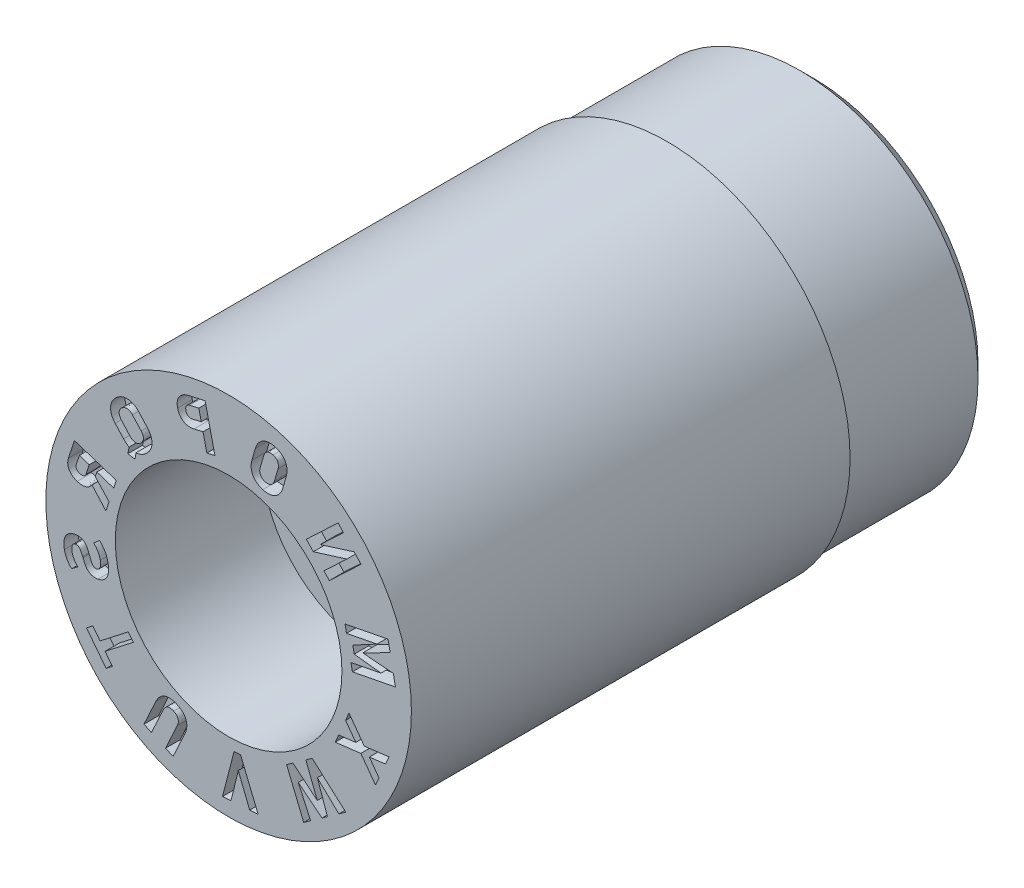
from build123d import *

# Parameters (mm, degrees)
SKETCH4_W          = 2
SKETCH4_H          = 1
CUT_EXTRUDE1_DEPTH = 0.2


with BuildPart() as part:
    # Sketch1 → Revolve1 (revolve)
    with BuildSketch(Plane(origin=(0, 0, 0), x_dir=(0, 0, -1), z_dir=(1, 0, 0)), mode=Mode.PRIVATE) as revolve1_sk:
        Polygon((0, 2.5), (0, 1.55), (2, 1.55), (2, 0.8), (8, 0.8), (8, 2.25), (7.75, 2.5), align=None)
    revolve(revolve1_sk.sketch.rotate(Axis((0, 0, 3.797909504), (0, 0, -1)), 90), axis=Axis((0, 0, 3.797909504), (0, 0, -1)))

    # Sketch4 → Cut-Revolve1 (revolve, cut)
    with BuildSketch(Plane(origin=(0, 0, 0), x_dir=(0, 0, -1), z_dir=(1, 0, 0)), mode=Mode.PRIVATE) as cut_revolve1_sk:
        with Locations((7, 2.935)):
            Rectangle(SKETCH4_W, SKETCH4_H)
    revolve(cut_revolve1_sk.sketch.rotate(Axis((0, 0, 0), (0, 0, -1)), 90), axis=Axis((0, 0, 0), (0, 0, -1)), mode=Mode.SUBTRACT)

    # Sketch6 → Cut-Extrude1 (cut)
    # profile 1 of 12: a face of its own
    with BuildSketch(Plane.XY):
        Polygon((2.20943311, 0.550372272), (2.180812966, 0.696563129), (1.592055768, 0.581519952), (1.611801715, 0.480679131), (2.029671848, 0.562317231), (1.698598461, 0.384971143), (1.717809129, 0.287079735), (2.083836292, 0.24583009), (1.673342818, 0.165633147), (1.693088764, 0.064792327), (2.281845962, 0.179835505), (2.253225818, 0.326026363), (1.834465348, 0.360595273), align=None)
    # profile 2 of 12: a face of its own
    with BuildSketch(Plane.XY):
        Polygon((1.811695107, 1.399001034), (1.717052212, 1.499012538), (1.25324376, 1.352655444), (1.571096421, 1.653347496), (1.497187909, 1.731422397), (1.063468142, 1.321117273), (1.15857305, 1.22059101), (1.616688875, 1.362763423), (1.303951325, 1.0668995), (1.377975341, 0.98869591), align=None)
    # profile 3 of 12: a face of its own
    with BuildSketch(Plane.XY):
        with BuildLine():
            Line((0.740518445, 1.762644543), (0.788028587, 1.926385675))
            add(Edge.make_bspline(
                [(0.788028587, 1.926385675), (0.79101625, 1.936685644), (0.794493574, 1.952186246), (0.79784375, 1.972851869), (0.798813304, 1.987962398), (0.799425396, 2.00278116), (0.798506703, 2.017368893), (0.796958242, 2.031715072), (0.794395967, 2.045793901), (0.791042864, 2.059559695), (0.786487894, 2.072797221), (0.781263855, 2.085609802), (0.775123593, 2.097914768), (0.768115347, 2.109756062), (0.760281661, 2.121107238), (0.751497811, 2.131923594), (0.741861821, 2.142159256), (0.73151523, 2.151973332), (0.720368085, 2.161032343), (0.708517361, 2.16942173), (0.695965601, 2.177091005), (0.682703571, 2.183989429), (0.663945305, 2.192637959), (0.649039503, 2.197557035), (0.638911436, 2.200623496)],
                knots=[0, 0, 0, 0, 0.091423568, 0.135488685, 0.178425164, 0.22052978, 0.261924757, 0.302982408, 0.343591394, 0.383929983, 0.42373898, 0.46291104, 0.501914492, 0.540950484, 0.580219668, 0.619478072, 0.659710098, 0.700084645, 0.741061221, 0.782148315, 0.823883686, 0.866451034, 0.909630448, 1, 1, 1, 1], degree=3))
            add(Edge.make_bspline(
                [(0.638911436, 2.200623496), (0.6287683, 2.203686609), (0.61344122, 2.207100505), (0.592964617, 2.210124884), (0.578016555, 2.211428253), (0.563278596, 2.211527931), (0.54878859, 2.210923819), (0.534503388, 2.209242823), (0.520528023, 2.206485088), (0.506830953, 2.203090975), (0.493695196, 2.198469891), (0.480948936, 2.193130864), (0.468658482, 2.187010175), (0.456944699, 2.179742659), (0.445681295, 2.171753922), (0.434771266, 2.162939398), (0.424599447, 2.153086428), (0.414833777, 2.142615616), (0.40584282, 2.131278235), (0.397317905, 2.119375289), (0.389758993, 2.106566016), (0.382680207, 2.0932095), (0.374146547, 2.074115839), (0.368957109, 2.059092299), (0.365990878, 2.048788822)],
                knots=[0, 0, 0, 0, 0.090266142, 0.133661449, 0.176402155, 0.218059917, 0.259222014, 0.299977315, 0.340536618, 0.380604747, 0.420164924, 0.459106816, 0.49837752, 0.53707214, 0.576497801, 0.616054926, 0.656506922, 0.697127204, 0.738031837, 0.779780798, 0.821838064, 0.864718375, 0.908600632, 1, 1, 1, 1], degree=3))
            Line((0.365990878, 2.048788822), (0.318480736, 1.88504769))
            add(Edge.make_bspline(
                [(0.318480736, 1.88504769), (0.315511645, 1.87474647), (0.311980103, 1.859249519), (0.308719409, 1.838596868), (0.307512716, 1.823500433), (0.307131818, 1.80867175), (0.307986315, 1.794063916), (0.30956774, 1.779721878), (0.312058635, 1.76565349), (0.315630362, 1.751983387), (0.319854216, 1.738675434), (0.325157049, 1.725892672), (0.331288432, 1.713590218), (0.33824392, 1.701728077), (0.346285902, 1.690482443), (0.354943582, 1.679521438), (0.364663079, 1.669289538), (0.374960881, 1.659427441), (0.386239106, 1.65053656), (0.398049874, 1.642105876), (0.41061042, 1.634446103), (0.423910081, 1.627536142), (0.442683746, 1.618821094), (0.457662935, 1.613981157), (0.467766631, 1.61084765)],
                knots=[0, 0, 0, 0, 0.09139278, 0.135443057, 0.17820288, 0.220472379, 0.261853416, 0.302897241, 0.34349255, 0.383578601, 0.423325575, 0.462484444, 0.50147476, 0.540497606, 0.579619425, 0.619305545, 0.659524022, 0.699884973, 0.740807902, 0.78188116, 0.823602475, 0.866155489, 0.909664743, 1, 1, 1, 1], degree=3))
            add(Edge.make_bspline(
                [(0.467766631, 1.61084765), (0.477929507, 1.607867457), (0.493234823, 1.604366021), (0.51367666, 1.601333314), (0.528595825, 1.600126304), (0.543295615, 1.600004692), (0.557787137, 1.600611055), (0.572068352, 1.602304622), (0.586030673, 1.605005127), (0.599673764, 1.60858804), (0.612863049, 1.613028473), (0.62562495, 1.618366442), (0.637815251, 1.62466937), (0.649587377, 1.631748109), (0.660926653, 1.63966272), (0.671584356, 1.648709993), (0.681978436, 1.65831583), (0.691662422, 1.668832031), (0.70067011, 1.680151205), (0.709190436, 1.692059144), (0.716750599, 1.704867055), (0.723829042, 1.718223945), (0.732362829, 1.737317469), (0.737552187, 1.752341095), (0.740518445, 1.762644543)],
                knots=[0, 0, 0, 0, 0.090323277, 0.133749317, 0.176212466, 0.21789973, 0.259090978, 0.299875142, 0.340463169, 0.380322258, 0.420128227, 0.459097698, 0.498218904, 0.537095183, 0.576227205, 0.616034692, 0.656263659, 0.696912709, 0.737846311, 0.779624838, 0.821711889, 0.864622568, 0.908535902, 1, 1, 1, 1], degree=3))
        make_face()
        with BuildLine():
            Line((0.430689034, 1.849656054), (0.479700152, 2.01896075))
            add(Edge.make_bspline(
                [(0.479700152, 2.01896075), (0.48253023, 2.028493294), (0.488025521, 2.042115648), (0.498207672, 2.058359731), (0.507024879, 2.068786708), (0.516874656, 2.077739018), (0.52766449, 2.085133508), (0.539418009, 2.090723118), (0.552046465, 2.094446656), (0.565260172, 2.096634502), (0.583998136, 2.097163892), (0.598095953, 2.094465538), (0.607378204, 2.091759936)],
                knots=[0, 0, 0, 0, 0.180182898, 0.264366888, 0.346348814, 0.426789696, 0.504846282, 0.582496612, 0.661552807, 0.742625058, 0.824550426, 1, 1, 1, 1], degree=3))
            add(Edge.make_bspline(
                [(0.607378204, 2.091759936), (0.616727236, 2.089255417), (0.629859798, 2.083647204), (0.645555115, 2.073481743), (0.655508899, 2.064510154), (0.66397786, 2.054472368), (0.671021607, 2.043536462), (0.676003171, 2.031433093), (0.679624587, 2.018614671), (0.681501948, 2.005074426), (0.681437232, 1.985921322), (0.678717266, 1.971509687), (0.675951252, 1.961983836)],
                knots=[0, 0, 0, 0, 0.175126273, 0.257195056, 0.338134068, 0.417160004, 0.494867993, 0.572993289, 0.65360079, 0.735948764, 0.820030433, 1, 1, 1, 1], degree=3))
            Line((0.675951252, 1.961983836), (0.626940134, 1.79267914))
            add(Edge.make_bspline(
                [(0.626940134, 1.79267914), (0.624108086, 1.783147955), (0.618618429, 1.769521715), (0.608406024, 1.753249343), (0.599579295, 1.742780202), (0.589740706, 1.733803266), (0.578896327, 1.726496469), (0.567215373, 1.720849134), (0.554643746, 1.716973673), (0.541415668, 1.714947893), (0.522718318, 1.714532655), (0.508604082, 1.71703967), (0.499365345, 1.719814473)],
                knots=[0, 0, 0, 0, 0.180243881, 0.264456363, 0.347198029, 0.427666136, 0.505071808, 0.583374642, 0.661976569, 0.74258696, 0.825153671, 1, 1, 1, 1], degree=3))
            add(Edge.make_bspline(
                [(0.499365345, 1.719814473), (0.489998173, 1.722372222), (0.476797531, 1.727950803), (0.461146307, 1.738158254), (0.451120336, 1.746972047), (0.44264669, 1.757034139), (0.435703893, 1.768058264), (0.430522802, 1.780107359), (0.426967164, 1.792927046), (0.42504371, 1.80649512), (0.425265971, 1.825685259), (0.427885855, 1.840129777), (0.430689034, 1.849656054)],
                knots=[0, 0, 0, 0, 0.175658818, 0.257640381, 0.33764587, 0.416587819, 0.495197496, 0.5728229, 0.653344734, 0.735605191, 0.820221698, 1, 1, 1, 1], degree=3))
        make_face(mode=Mode.SUBTRACT)
    # profile 4 of 12: a face of its own
    with BuildSketch(Plane.XY):
        with BuildLine():
            Line((-0.349619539, 1.887561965), (-0.297495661, 1.661224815))
            Line((-0.297495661, 1.661224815), (-0.187530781, 1.686483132))
            Line((-0.187530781, 1.686483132), (-0.321891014, 2.269914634))
            Line((-0.321891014, 2.269914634), (-0.55585496, 2.216100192))
            add(Edge.make_bspline(
                [(-0.55585496, 2.216100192), (-0.573133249, 2.212296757), (-0.597823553, 2.203759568), (-0.627560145, 2.187001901), (-0.646910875, 2.17221902), (-0.663908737, 2.155476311), (-0.677898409, 2.136663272), (-0.689206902, 2.116220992), (-0.697261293, 2.09405388), (-0.702598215, 2.070633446), (-0.705028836, 2.037221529), (-0.702038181, 2.011783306), (-0.698008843, 1.994967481)],
                knots=[0, 0, 0, 0, 0.179264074, 0.262914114, 0.345094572, 0.425466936, 0.504017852, 0.581987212, 0.661488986, 0.742357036, 0.824785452, 1, 1, 1, 1], degree=3))
            add(Edge.make_bspline(
                [(-0.698008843, 1.994967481), (-0.694085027, 1.978136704), (-0.68591246, 1.953841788), (-0.668936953, 1.924968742), (-0.653950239, 1.906300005), (-0.63694929, 1.890038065), (-0.617909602, 1.876660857), (-0.597078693, 1.866089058), (-0.574632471, 1.858326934), (-0.550780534, 1.853765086), (-0.51677128, 1.851637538), (-0.490839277, 1.854977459), (-0.473639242, 1.859013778)],
                knots=[0, 0, 0, 0, 0.175740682, 0.257985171, 0.339043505, 0.41817568, 0.496190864, 0.574525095, 0.654741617, 0.73663625, 0.820445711, 1, 1, 1, 1], degree=3))
            Line((-0.473639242, 1.859013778), (-0.349619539, 1.887561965))
        make_face()
        with BuildLine():
            Line((-0.374006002, 1.993455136), (-0.500806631, 1.964241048))
            add(Edge.make_bspline(
                [(-0.500806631, 1.964241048), (-0.50703459, 1.962914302), (-0.516478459, 1.961674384), (-0.528897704, 1.96280841), (-0.537645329, 1.965055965), (-0.545995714, 1.96830671), (-0.553648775, 1.97298082), (-0.560816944, 1.978534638), (-0.567189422, 1.985297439), (-0.572864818, 1.992992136), (-0.57924717, 2.004776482), (-0.582665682, 2.014428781), (-0.584041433, 2.021222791)],
                knots=[0, 0, 0, 0, 0.168779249, 0.249596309, 0.32843233, 0.407061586, 0.485720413, 0.564814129, 0.646318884, 0.730711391, 0.817085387, 1, 1, 1, 1], degree=3))
            add(Edge.make_bspline(
                [(-0.584041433, 2.021222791), (-0.585591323, 2.028062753), (-0.587071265, 2.03829928), (-0.586502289, 2.05180504), (-0.584863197, 2.061260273), (-0.58220069, 2.070213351), (-0.578331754, 2.07846219), (-0.573392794, 2.085918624), (-0.5673683, 2.092514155), (-0.560513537, 2.098397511), (-0.549692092, 2.104846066), (-0.540637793, 2.108140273), (-0.534279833, 2.109509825)],
                knots=[0, 0, 0, 0, 0.184525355, 0.269846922, 0.354276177, 0.436138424, 0.514600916, 0.592865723, 0.67024582, 0.748708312, 0.829398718, 1, 1, 1, 1], degree=3))
            Line((-0.534279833, 2.109509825), (-0.407461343, 2.138728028))
            Line((-0.407461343, 2.138728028), (-0.374006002, 1.993455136))
        make_face(mode=Mode.SUBTRACT)
    # profile 5 of 12: a face of its own
    with BuildSketch(Plane.XY):
        with BuildLine():
            Line((-1.802329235, 0.685143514), (-1.572052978, 0.610220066))
            Line((-1.572052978, 0.610220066), (-1.536933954, 0.718097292))
            Line((-1.536933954, 0.718097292), (-2.109772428, 0.904477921))
            Line((-2.109772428, 0.904477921), (-2.191337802, 0.653698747))
            add(Edge.make_bspline(
                [(-2.191337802, 0.653698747), (-2.196431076, 0.638769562), (-2.200715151, 0.615861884), (-2.201039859, 0.585321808), (-2.197602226, 0.563588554), (-2.191453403, 0.542792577), (-2.182250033, 0.523212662), (-2.170186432, 0.505002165), (-2.155381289, 0.488172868), (-2.138024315, 0.472910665), (-2.110760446, 0.454868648), (-2.087756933, 0.444882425), (-2.071591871, 0.439637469)],
                knots=[0, 0, 0, 0, 0.170965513, 0.251492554, 0.330726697, 0.409120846, 0.486425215, 0.564906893, 0.645708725, 0.729313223, 0.815308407, 1, 1, 1, 1], degree=3))
            add(Edge.make_bspline(
                [(-2.071591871, 0.439637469), (-2.05546635, 0.434344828), (-2.03105239, 0.428858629), (-1.99843022, 0.427553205), (-1.975448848, 0.429720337), (-1.953459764, 0.434390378), (-1.9329949, 0.442252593), (-1.913927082, 0.45268094), (-1.89673242, 0.466053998), (-1.881619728, 0.481391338), (-1.873125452, 0.492834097), (-1.869352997, 0.498636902)],
                knots=[0, 0, 0, 0, 0.184562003, 0.270099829, 0.353927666, 0.434921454, 0.513703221, 0.591414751, 0.670359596, 0.749632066, 0.824814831, 0.824814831, 0.824814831, 0.824814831], degree=3))
            Line((-1.869352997, 0.498636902), (-1.677853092, 0.28494394))
            Line((-1.677853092, 0.28494394), (-1.63528215, 0.415688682))
            Line((-1.63528215, 0.415688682), (-1.82365503, 0.619609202))
            Line((-1.82365503, 0.619609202), (-1.802329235, 0.685143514))
        make_face()
        with BuildLine():
            Line((-1.906319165, 0.718978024), (-1.950041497, 0.584652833))
            add(Edge.make_bspline(
                [(-1.950041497, 0.584652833), (-1.951864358, 0.579467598), (-1.955102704, 0.571849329), (-1.96194396, 0.563485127), (-1.9676883, 0.558104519), (-1.974154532, 0.553519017), (-1.981460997, 0.550147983), (-1.989339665, 0.547663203), (-1.997835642, 0.546313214), (-2.006780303, 0.545867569), (-2.019499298, 0.546754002), (-2.029127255, 0.548463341), (-2.035461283, 0.550560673)],
                knots=[0, 0, 0, 0, 0.160903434, 0.236925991, 0.313022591, 0.389571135, 0.466559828, 0.546297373, 0.62936432, 0.716274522, 0.806460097, 1, 1, 1, 1], degree=3))
            add(Edge.make_bspline(
                [(-2.035461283, 0.550560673), (-2.041739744, 0.552721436), (-2.050838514, 0.556412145), (-2.061634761, 0.563224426), (-2.068582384, 0.568889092), (-2.074508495, 0.57507162), (-2.07966628, 0.581567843), (-2.083295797, 0.588784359), (-2.086177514, 0.596225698), (-2.087531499, 0.604044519), (-2.088339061, 0.614927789), (-2.086316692, 0.623111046), (-2.084739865, 0.628443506)],
                knots=[0, 0, 0, 0, 0.192761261, 0.282732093, 0.369094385, 0.451825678, 0.530688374, 0.608347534, 0.685012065, 0.761064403, 0.837446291, 1, 1, 1, 1], degree=3))
            Line((-2.084739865, 0.628443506), (-2.041007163, 0.762800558))
            Line((-2.041007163, 0.762800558), (-1.906319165, 0.718978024))
        make_face(mode=Mode.SUBTRACT)
    # profile 6 of 12: a face of its own
    with BuildSketch(Plane.XY):
        Polygon((-1.758557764, -1.294256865), (-1.858436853, -1.16574307), (-1.944117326, -1.232303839), (-1.675281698, -1.578212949), (-1.589601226, -1.511652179), (-1.689517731, -1.383090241), (-1.303268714, -1.082944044), (-1.372303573, -0.994106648), align=None)
    # profile 7 of 12: a face of its own
    with BuildSketch(Plane.XY):
        with BuildLine():
            Line((-1.361412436, 1.201971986), (-1.378089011, 1.113086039))
            Line((-1.378089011, 1.113086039), (-1.281769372, 1.096606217))
            Line((-1.281769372, 1.096606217), (-1.266002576, 1.181280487))
            add(Edge.make_bspline(
                [(-1.266002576, 1.181280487), (-1.262917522, 1.181412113), (-1.255198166, 1.181925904), (-1.242895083, 1.183668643), (-1.229075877, 1.186368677), (-1.215365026, 1.19006818), (-1.201828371, 1.194837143), (-1.188533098, 1.200566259), (-1.175418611, 1.207218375), (-1.162517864, 1.214810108), (-1.145498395, 1.226551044), (-1.133219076, 1.236325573), (-1.125444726, 1.243518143)],
                knots=[0.553532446, 0.553532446, 0.553532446, 0.553532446, 0.579886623, 0.61955895, 0.659523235, 0.700048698, 0.740686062, 0.781956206, 0.82356533, 0.866163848, 0.909650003, 1, 1, 1, 1], degree=3))
            add(Edge.make_bspline(
                [(-1.125444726, 1.243518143), (-1.117647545, 1.250661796), (-1.106543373, 1.261734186), (-1.093348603, 1.277603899), (-1.084573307, 1.289717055), (-1.076587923, 1.302083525), (-1.069579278, 1.314834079), (-1.063544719, 1.327886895), (-1.058439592, 1.341184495), (-1.054355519, 1.354629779), (-1.051140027, 1.36818437), (-1.049135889, 1.381797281), (-1.048112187, 1.39548231), (-1.047827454, 1.409178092), (-1.048738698, 1.422986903), (-1.050815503, 1.436811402), (-1.053586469, 1.450694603), (-1.057455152, 1.464483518), (-1.062320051, 1.478113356), (-1.068092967, 1.491562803), (-1.075098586, 1.504672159), (-1.082749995, 1.517681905), (-1.094450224, 1.535015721), (-1.104604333, 1.547229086), (-1.111783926, 1.555191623)],
                knots=[0, 0, 0, 0, 0.090272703, 0.13359385, 0.176011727, 0.217862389, 0.259154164, 0.300080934, 0.340506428, 0.380620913, 0.419929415, 0.45929329, 0.497912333, 0.53699856, 0.576115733, 0.615854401, 0.656237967, 0.696872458, 0.737957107, 0.779684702, 0.821655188, 0.864724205, 0.908462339, 1, 1, 1, 1], degree=3))
            Line((-1.111783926, 1.555191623), (-1.226219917, 1.68125686))
            add(Edge.make_bspline(
                [(-1.226219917, 1.68125686), (-1.233447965, 1.689126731), (-1.244597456, 1.700408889), (-1.260681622, 1.713722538), (-1.27276629, 1.722830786), (-1.285357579, 1.730705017), (-1.298031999, 1.737953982), (-1.31115563, 1.743911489), (-1.324407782, 1.749165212), (-1.337864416, 1.753443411), (-1.351504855, 1.756510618), (-1.365136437, 1.7588982), (-1.378827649, 1.76004174), (-1.392554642, 1.760231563), (-1.406355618, 1.759526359), (-1.420174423, 1.757565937), (-1.433994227, 1.754867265), (-1.447703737, 1.751165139), (-1.461245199, 1.746405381), (-1.474553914, 1.740627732), (-1.487737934, 1.734104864), (-1.500562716, 1.7263781), (-1.517582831, 1.714704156), (-1.529844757, 1.704899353), (-1.537625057, 1.697717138)],
                knots=[0, 0, 0, 0, 0.091297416, 0.135124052, 0.178219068, 0.220400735, 0.261852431, 0.302799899, 0.343340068, 0.383545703, 0.42321907, 0.462645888, 0.501627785, 0.540386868, 0.579813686, 0.619491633, 0.659461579, 0.699992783, 0.740635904, 0.781911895, 0.823821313, 0.866144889, 0.909637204, 1, 1, 1, 1], degree=3))
            add(Edge.make_bspline(
                [(-1.537625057, 1.697717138), (-1.545406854, 1.690562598), (-1.55655582, 1.679521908), (-1.569692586, 1.663585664), (-1.578662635, 1.651607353), (-1.586442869, 1.639105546), (-1.593502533, 1.626465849), (-1.599383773, 1.613397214), (-1.604503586, 1.600163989), (-1.608591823, 1.586676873), (-1.611801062, 1.573118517), (-1.613756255, 1.559464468), (-1.615044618, 1.545793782), (-1.615065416, 1.532047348), (-1.614221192, 1.51823783), (-1.612147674, 1.504447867), (-1.609327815, 1.490615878), (-1.605486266, 1.476860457), (-1.60062658, 1.463286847), (-1.594904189, 1.449842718), (-1.588031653, 1.436720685), (-1.580250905, 1.423785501), (-1.56861537, 1.406451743), (-1.558432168, 1.394255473), (-1.551262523, 1.386287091)],
                knots=[0, 0, 0, 0, 0.090349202, 0.13370706, 0.176338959, 0.218067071, 0.259393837, 0.299911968, 0.34037172, 0.380520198, 0.420207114, 0.459256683, 0.498251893, 0.537400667, 0.576550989, 0.616323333, 0.656408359, 0.697077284, 0.738196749, 0.779486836, 0.821784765, 0.864609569, 0.908384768, 1, 1, 1, 1], degree=3))
            Line((-1.551262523, 1.386287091), (-1.436826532, 1.260221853))
            add(Edge.make_bspline(
                [(-1.436826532, 1.260221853), (-1.429616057, 1.252329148), (-1.418375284, 1.241073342), (-1.402367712, 1.22765819), (-1.390178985, 1.218667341), (-1.377779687, 1.210585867), (-1.368040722, 1.205282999), (-1.362565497, 1.202538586), (-1.361412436, 1.201971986)],
                knots=[0, 0, 0, 0, 0.091284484, 0.135588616, 0.178199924, 0.220534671, 0.261841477, 0.272807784, 0.272807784, 0.272807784, 0.272807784], degree=3))
        make_face()
        with BuildLine():
            Line((-1.347921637, 1.336824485), (-1.466232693, 1.467314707))
            add(Edge.make_bspline(
                [(-1.466232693, 1.467314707), (-1.472989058, 1.474549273), (-1.481628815, 1.486353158), (-1.490019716, 1.503523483), (-1.494314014, 1.516455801), (-1.496774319, 1.529541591), (-1.497442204, 1.542590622), (-1.496009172, 1.555528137), (-1.492878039, 1.568281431), (-1.487649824, 1.580588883), (-1.478379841, 1.596816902), (-1.468676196, 1.607412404), (-1.461517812, 1.613895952)],
                knots=[0, 0, 0, 0, 0.179565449, 0.263572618, 0.346063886, 0.426154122, 0.504635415, 0.582331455, 0.661652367, 0.742165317, 0.824284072, 1, 1, 1, 1], degree=3))
            add(Edge.make_bspline(
                [(-1.461517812, 1.613895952), (-1.454401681, 1.620437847), (-1.442836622, 1.628873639), (-1.425894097, 1.636782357), (-1.413060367, 1.640599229), (-1.400091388, 1.6425584), (-1.387095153, 1.642695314), (-1.374138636, 1.640969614), (-1.361352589, 1.63724378), (-1.348878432, 1.631694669), (-1.332559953, 1.62170122), (-1.321699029, 1.611818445), (-1.315014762, 1.604520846)],
                knots=[0, 0, 0, 0, 0.175372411, 0.25756761, 0.338183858, 0.417466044, 0.494810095, 0.573260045, 0.653764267, 0.735619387, 0.820295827, 1, 1, 1, 1], degree=3))
            Line((-1.315014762, 1.604520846), (-1.196703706, 1.474030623))
            add(Edge.make_bspline(
                [(-1.196703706, 1.474030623), (-1.189960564, 1.466730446), (-1.18141123, 1.454836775), (-1.172778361, 1.43772387), (-1.16853415, 1.424752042), (-1.166001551, 1.4116777), (-1.165564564, 1.398629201), (-1.166870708, 1.385715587), (-1.17025574, 1.373062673), (-1.175361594, 1.360725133), (-1.184917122, 1.344667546), (-1.194255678, 1.333832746), (-1.201540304, 1.327461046)],
                knots=[0, 0, 0, 0, 0.180070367, 0.264455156, 0.34693737, 0.427018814, 0.505390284, 0.583077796, 0.661773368, 0.742277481, 0.824696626, 1, 1, 1, 1], degree=3))
            add(Edge.make_bspline(
                [(-1.201540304, 1.327461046), (-1.208764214, 1.321072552), (-1.220201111, 1.312446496), (-1.237135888, 1.304600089), (-1.249924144, 1.300759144), (-1.262840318, 1.298640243), (-1.275861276, 1.298497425), (-1.28875225, 1.30040183), (-1.301536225, 1.304115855), (-1.313989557, 1.309651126), (-1.330499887, 1.319426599), (-1.341126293, 1.329641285), (-1.347921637, 1.336824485)],
                knots=[0, 0, 0, 0, 0.175397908, 0.257631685, 0.337600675, 0.417102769, 0.494483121, 0.573001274, 0.652816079, 0.735411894, 0.81980758, 1, 1, 1, 1], degree=3))
        make_face(mode=Mode.SUBTRACT)
    # profile 8 of 12: a face of its own
    with BuildSketch(Plane.XY):
        with BuildLine():
            Line((-1.765725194, -0.108736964), (-1.847242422, -0.178033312))
            add(Edge.make_bspline(
                [(-1.847242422, -0.178033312), (-1.835663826, -0.187660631), (-1.819579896, -0.20386219), (-1.801072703, -0.228282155), (-1.788573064, -0.248202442), (-1.777453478, -0.269187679), (-1.765333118, -0.298472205), (-1.758621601, -0.321287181), (-1.755765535, -0.336855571)],
                knots=[0, 0, 0, 0, 0.241735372, 0.365131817, 0.49149883, 0.619116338, 0.746132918, 1, 1, 1, 1], degree=3))
            add(Edge.make_bspline(
                [(-1.755765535, -0.336855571), (-1.754093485, -0.34541049), (-1.752024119, -0.35798632), (-1.750989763, -0.374451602), (-1.75087093, -0.385774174), (-1.751343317, -0.396442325), (-1.752764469, -0.40647387), (-1.754808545, -0.415867), (-1.757653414, -0.424600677), (-1.761072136, -0.432590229), (-1.765180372, -0.439804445), (-1.770160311, -0.446006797), (-1.775532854, -0.451594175), (-1.781701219, -0.456245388), (-1.791045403, -0.461235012), (-1.798763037, -0.463660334), (-1.804102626, -0.464731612)],
                knots=[0, 0, 0, 0, 0.170855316, 0.249125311, 0.322961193, 0.392611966, 0.458073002, 0.521193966, 0.580691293, 0.637715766, 0.691216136, 0.74271294, 0.793140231, 0.842719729, 0.893329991, 1, 1, 1, 1], degree=3))
            add(Edge.make_bspline(
                [(-1.804102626, -0.464731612), (-1.811540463, -0.466122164), (-1.822345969, -0.467095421), (-1.835752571, -0.463370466), (-1.844520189, -0.458875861), (-1.85235929, -0.452813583), (-1.859503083, -0.445636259), (-1.865975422, -0.437274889), (-1.871690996, -0.42758191), (-1.876971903, -0.416485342), (-1.884866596, -0.399057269), (-1.890179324, -0.384920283), (-1.893766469, -0.374994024)],
                knots=[0, 0, 0, 0, 0.155575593, 0.225864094, 0.295100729, 0.365091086, 0.43699993, 0.511265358, 0.590691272, 0.677237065, 0.774094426, 1, 1, 1, 1], degree=3))
            add(Edge.make_bspline(
                [(-1.893766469, -0.374994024), (-1.894144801, -0.374321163), (-1.894883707, -0.372929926), (-1.895106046, -0.371369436), (-1.895515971, -0.37068955)],
                knots=[0, 0, 0, 0, 0.499927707, 1, 1, 1, 1], degree=3))
            Line((-1.895515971, -0.37068955), (-1.898469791, -0.362122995))
            add(Edge.make_bspline(
                [(-1.898469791, -0.362122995), (-1.90480576, -0.344515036), (-1.914863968, -0.319524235), (-1.929529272, -0.288493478), (-1.940331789, -0.268693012), (-1.95239726, -0.251071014), (-1.966932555, -0.235855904), (-1.983691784, -0.22248833), (-1.999496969, -0.213296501), (-2.013252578, -0.207090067), (-2.024559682, -0.203645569), (-2.036564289, -0.201086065), (-2.049330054, -0.199744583), (-2.062837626, -0.199231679), (-2.082387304, -0.200009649), (-2.097344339, -0.202160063), (-2.107445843, -0.20420116)],
                knots=[0, 0, 0, 0, 0.190487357, 0.274035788, 0.349278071, 0.419937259, 0.490748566, 0.562646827, 0.63750487, 0.676237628, 0.71602935, 0.757573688, 0.801020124, 0.846520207, 0.895085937, 1, 1, 1, 1], degree=3))
            add(Edge.make_bspline(
                [(-2.107445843, -0.20420116), (-2.117137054, -0.206124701), (-2.130607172, -0.209409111), (-2.147668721, -0.215646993), (-2.159598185, -0.220893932), (-2.170914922, -0.226737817), (-2.181477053, -0.233487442), (-2.191418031, -0.240768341), (-2.200627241, -0.248793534), (-2.209210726, -0.257364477), (-2.216843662, -0.266789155), (-2.223984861, -0.276634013), (-2.230292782, -0.287159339), (-2.235789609, -0.29826744), (-2.240652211, -0.309952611), (-2.244677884, -0.322264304), (-2.248064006, -0.335165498), (-2.250637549, -0.348597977), (-2.252350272, -0.362588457), (-2.253342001, -0.377073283), (-2.253352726, -0.392086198), (-2.252982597, -0.407573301), (-2.25085125, -0.429251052), (-2.248388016, -0.445669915), (-2.24621228, -0.456734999)],
                knots=[0, 0, 0, 0, 0.086214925, 0.12706628, 0.166782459, 0.205913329, 0.24396833, 0.281847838, 0.319037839, 0.356118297, 0.393153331, 0.430352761, 0.467805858, 0.505751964, 0.544153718, 0.584005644, 0.624679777, 0.666648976, 0.709574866, 0.75413146, 0.799968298, 0.847486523, 0.896418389, 1, 1, 1, 1], degree=3))
            add(Edge.make_bspline(
                [(-2.24621228, -0.456734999), (-2.244118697, -0.467396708), (-2.240204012, -0.483384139), (-2.232830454, -0.504212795), (-2.22450706, -0.525384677), (-2.211551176, -0.551140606), (-2.187072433, -0.590649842), (-2.164510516, -0.617508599), (-2.14793545, -0.633911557)],
                knots=[0, 0, 0, 0, 0.158663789, 0.239683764, 0.322383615, 0.490623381, 0.659638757, 1, 1, 1, 1], degree=3))
            Line((-2.14793545, -0.633911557), (-2.063058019, -0.568660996))
            add(Edge.make_bspline(
                [(-2.063058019, -0.568660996), (-2.073035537, -0.559131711), (-2.086513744, -0.543632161), (-2.102836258, -0.521828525), (-2.11345453, -0.504907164), (-2.122724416, -0.487775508), (-2.132647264, -0.465176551), (-2.137738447, -0.44769807), (-2.140062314, -0.43602957)],
                knots=[0, 0, 0, 0, 0.265630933, 0.395425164, 0.524752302, 0.650410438, 0.77068258, 1, 1, 1, 1], degree=3))
            add(Edge.make_bspline(
                [(-2.140062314, -0.43602957), (-2.141638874, -0.428005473), (-2.143442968, -0.416186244), (-2.144689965, -0.400793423), (-2.144917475, -0.390186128), (-2.144275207, -0.380214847), (-2.143370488, -0.370791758), (-2.141397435, -0.36203679), (-2.138942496, -0.35388389), (-2.13585841, -0.346392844), (-2.131963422, -0.339809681), (-2.127748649, -0.333853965), (-2.122761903, -0.328784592), (-2.117142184, -0.324547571), (-2.108873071, -0.319629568), (-2.101756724, -0.317701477), (-2.096991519, -0.316629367)],
                knots=[0, 0, 0, 0, 0.172878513, 0.252449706, 0.326376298, 0.396910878, 0.463615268, 0.526231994, 0.586251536, 0.643523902, 0.696953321, 0.74764458, 0.797426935, 0.846548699, 0.896144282, 1, 1, 1, 1], degree=3))
            add(Edge.make_bspline(
                [(-2.096991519, -0.316629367), (-2.088907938, -0.314851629), (-2.077285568, -0.314410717), (-2.062654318, -0.317956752), (-2.053282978, -0.323045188), (-2.044952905, -0.329590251), (-2.037216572, -0.337039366), (-2.03045292, -0.345622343), (-2.024367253, -0.355416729), (-2.018501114, -0.366849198), (-2.009454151, -0.385916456), (-2.002958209, -0.40155622), (-1.998324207, -0.412606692)],
                knots=[0, 0, 0, 0, 0.15650919, 0.226935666, 0.295703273, 0.365930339, 0.436453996, 0.508010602, 0.581837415, 0.664611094, 0.762498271, 1, 1, 1, 1], degree=3))
            add(Edge.make_bspline(
                [(-1.998324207, -0.412606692), (-1.997792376, -0.413585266), (-1.997323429, -0.415799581), (-1.996285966, -0.417807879), (-1.99590531, -0.418882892)],
                knots=[0, 0, 0, 0, 0.491264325, 1, 1, 1, 1], degree=3))
            add(Edge.make_bspline(
                [(-1.99590531, -0.418882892), (-1.995359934, -0.420424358), (-1.993968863, -0.423331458), (-1.992574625, -0.426237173), (-1.992041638, -0.427739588)],
                knots=[0, 0, 0, 0, 0.506324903, 1, 1, 1, 1], degree=3))
            add(Edge.make_bspline(
                [(-1.992041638, -0.427739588), (-1.985251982, -0.444303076), (-1.97493027, -0.468010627), (-1.959294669, -0.497110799), (-1.947823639, -0.515854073), (-1.9352562, -0.532536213), (-1.920395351, -0.546773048), (-1.903673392, -0.559136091), (-1.888145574, -0.567690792), (-1.874682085, -0.573215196), (-1.863752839, -0.576315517), (-1.852261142, -0.578695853), (-1.84008947, -0.57988342), (-1.827328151, -0.580270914), (-1.80895758, -0.579525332), (-1.794970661, -0.57724555), (-1.785460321, -0.575547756)],
                knots=[0, 0, 0, 0, 0.189722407, 0.273551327, 0.349792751, 0.422392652, 0.494119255, 0.566989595, 0.642183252, 0.681269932, 0.720922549, 0.762359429, 0.805437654, 0.850288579, 0.89754632, 1, 1, 1, 1], degree=3))
            add(Edge.make_bspline(
                [(-1.785460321, -0.575547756), (-1.775557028, -0.573639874), (-1.76236066, -0.570170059), (-1.745456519, -0.564101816), (-1.733694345, -0.558753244), (-1.722549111, -0.552823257), (-1.712143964, -0.5460598), (-1.702416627, -0.538532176), (-1.693318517, -0.530323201), (-1.684826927, -0.521520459), (-1.677299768, -0.511866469), (-1.670194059, -0.501795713), (-1.664129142, -0.490932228), (-1.658584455, -0.479571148), (-1.654047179, -0.467467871), (-1.650066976, -0.454786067), (-1.646905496, -0.441449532), (-1.644546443, -0.427545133), (-1.642844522, -0.413139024), (-1.64206972, -0.398240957), (-1.641972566, -0.382837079), (-1.642628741, -0.366868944), (-1.644852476, -0.344506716), (-1.647392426, -0.327546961), (-1.649615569, -0.316150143)],
                knots=[0, 0, 0, 0, 0.083525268, 0.12344597, 0.162628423, 0.200523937, 0.237760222, 0.27495251, 0.311876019, 0.348744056, 0.385626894, 0.422714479, 0.460328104, 0.498245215, 0.537184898, 0.577339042, 0.618647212, 0.661286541, 0.705093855, 0.750037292, 0.796409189, 0.844662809, 0.894796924, 1, 1, 1, 1], degree=3))
            add(Edge.make_bspline(
                [(-1.649615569, -0.316150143), (-1.652457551, -0.302273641), (-1.657299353, -0.281596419), (-1.666295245, -0.254844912), (-1.673952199, -0.235313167), (-1.682552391, -0.21642735), (-1.692015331, -0.19822714), (-1.702543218, -0.180937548), (-1.713701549, -0.164339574), (-1.72568709, -0.148808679), (-1.742400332, -0.129662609), (-1.756049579, -0.116608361), (-1.765725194, -0.108736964)],
                knots=[0, 0, 0, 0, 0.175447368, 0.262413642, 0.349208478, 0.435060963, 0.51921059, 0.602996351, 0.68553297, 0.766697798, 0.84568622, 1, 1, 1, 1], degree=3))
        make_face()
    # profile 9 of 12: a face of its own
    with BuildSketch(Plane.XY):
        with BuildLine():
            Line((-0.997045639, -1.632487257), (-1.157908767, -1.980183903))
            Line((-1.157908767, -1.980183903), (-1.055206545, -2.027624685))
            Line((-1.055206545, -2.027624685), (-0.893081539, -1.677256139))
            add(Edge.make_bspline(
                [(-0.893081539, -1.677256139), (-0.889681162, -1.669891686), (-0.884053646, -1.659341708), (-0.874893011, -1.646838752), (-0.867932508, -1.638505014), (-0.860237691, -1.63147205), (-0.852264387, -1.625196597), (-0.843595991, -1.620239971), (-0.834584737, -1.616054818), (-0.82515091, -1.613038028), (-0.81538531, -1.611120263), (-0.805364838, -1.610299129), (-0.79506712, -1.610666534), (-0.78451679, -1.612061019), (-0.7697339, -1.615559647), (-0.758881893, -1.619913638), (-0.751618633, -1.623099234)],
                knots=[0, 0, 0, 0, 0.141431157, 0.207199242, 0.269751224, 0.330155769, 0.388433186, 0.446084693, 0.503613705, 0.561221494, 0.618103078, 0.676609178, 0.735915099, 0.797226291, 0.861682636, 1, 1, 1, 1], degree=3))
            add(Edge.make_bspline(
                [(-0.751618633, -1.623099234), (-0.744352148, -1.626474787), (-0.73400651, -1.63213112), (-0.721685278, -1.641204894), (-0.71367595, -1.648315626), (-0.706720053, -1.655956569), (-0.700703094, -1.664104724), (-0.695930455, -1.672877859), (-0.692013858, -1.682002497), (-0.689216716, -1.69154926), (-0.687678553, -1.701427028), (-0.686953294, -1.711558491), (-0.68754949, -1.722012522), (-0.689094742, -1.732784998), (-0.692980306, -1.747844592), (-0.697032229, -1.759052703), (-0.700562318, -1.76638804)],
                knots=[0, 0, 0, 0, 0.139055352, 0.203712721, 0.265109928, 0.324541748, 0.382676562, 0.440362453, 0.49739025, 0.554680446, 0.612400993, 0.670522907, 0.730553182, 0.793676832, 0.859022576, 1, 1, 1, 1], degree=3))
            Line((-0.700562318, -1.76638804), (-0.862687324, -2.116756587))
            Line((-0.862687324, -2.116756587), (-0.759985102, -2.164197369))
            Line((-0.759985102, -2.164197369), (-0.599121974, -1.816500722))
            add(Edge.make_bspline(
                [(-0.599121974, -1.816500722), (-0.594469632, -1.806143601), (-0.58794149, -1.790693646), (-0.581270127, -1.769738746), (-0.577291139, -1.754551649), (-0.574377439, -1.739578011), (-0.572592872, -1.724857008), (-0.57162042, -1.710391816), (-0.571635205, -1.696149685), (-0.572724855, -1.682224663), (-0.574871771, -1.668635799), (-0.577866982, -1.655420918), (-0.582037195, -1.642600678), (-0.586913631, -1.6300845), (-0.593014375, -1.618062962), (-0.599992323, -1.606360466), (-0.607988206, -1.595078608), (-0.616914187, -1.584166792), (-0.626728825, -1.573744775), (-0.637430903, -1.563738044), (-0.649146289, -1.554380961), (-0.661620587, -1.54527386), (-0.679872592, -1.533770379), (-0.694610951, -1.52643452), (-0.704622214, -1.521574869)],
                knots=[0, 0, 0, 0, 0.095692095, 0.141037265, 0.185139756, 0.227873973, 0.269422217, 0.309971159, 0.34993006, 0.389282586, 0.427496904, 0.465731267, 0.503285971, 0.540959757, 0.578764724, 0.616694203, 0.655641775, 0.695130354, 0.7353524, 0.776149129, 0.818435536, 0.861569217, 0.906197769, 1, 1, 1, 1], degree=3))
            add(Edge.make_bspline(
                [(-0.704622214, -1.521574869), (-0.714773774, -1.517005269), (-0.729964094, -1.510569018), (-0.750635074, -1.504263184), (-0.765597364, -1.500295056), (-0.780379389, -1.497661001), (-0.794893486, -1.495912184), (-0.809153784, -1.495134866), (-0.823155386, -1.495462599), (-0.836885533, -1.496782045), (-0.85028701, -1.498990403), (-0.863312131, -1.50235258), (-0.876052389, -1.506434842), (-0.888378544, -1.511811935), (-0.90032604, -1.518152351), (-0.912069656, -1.525243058), (-0.923263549, -1.533549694), (-0.934115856, -1.542730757), (-0.944503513, -1.552839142), (-0.954448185, -1.563844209), (-0.963927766, -1.575763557), (-0.973020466, -1.5885618), (-0.984457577, -1.607341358), (-0.992402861, -1.622110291), (-0.997045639, -1.632487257)],
                knots=[0, 0, 0, 0, 0.093952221, 0.138762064, 0.18214969, 0.224393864, 0.265246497, 0.30536246, 0.344705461, 0.383221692, 0.421591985, 0.459095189, 0.496557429, 0.534282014, 0.572304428, 0.610557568, 0.649832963, 0.689699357, 0.730346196, 0.771952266, 0.814684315, 0.858696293, 0.904234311, 1, 1, 1, 1], degree=3))
        make_face()
    # profile 10 of 12: a face of its own
    with BuildSketch(Plane.XY):
        Polygon((-0.08395477, -2.300507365), (0.032447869, -2.292523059), (0.132466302, -1.883562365), (0.287378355, -2.274993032), (0.403780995, -2.267008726), (0.162960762, -1.68077816), (0.074564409, -1.686886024), align=None)
    # profile 11 of 12: a face of its own
    with BuildSketch(Plane.XY):
        Polygon((1.278016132, -1.873536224), (1.351884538, -1.82105113), (1.213793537, -1.428975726), (1.508067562, -1.710102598), (1.602777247, -1.642899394), (1.143390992, -1.234405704), (1.056619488, -1.295970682), (1.21233215, -1.698762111), (0.879358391, -1.421943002), (0.792742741, -1.483433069), (1.027123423, -2.05168796), (1.121717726, -1.984444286), (0.953086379, -1.614051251), align=None)
    # profile 12 of 12: a face of its own
    with BuildSketch(Plane.XY):
        Polygon((1.808753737, -0.842552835), (2.009623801, -1.118163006), (2.056659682, -1.008832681), (1.924914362, -0.828142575), (2.146203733, -0.800686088), (2.193239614, -0.691355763), (1.855417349, -0.733236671), (1.646597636, -0.446402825), (1.599561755, -0.55573315), (1.739600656, -0.74760693), (1.504559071, -0.776789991), (1.45752319, -0.886120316), align=None)
    extrude(amount=-CUT_EXTRUDE1_DEPTH, mode=Mode.SUBTRACT)


solid = part.part
